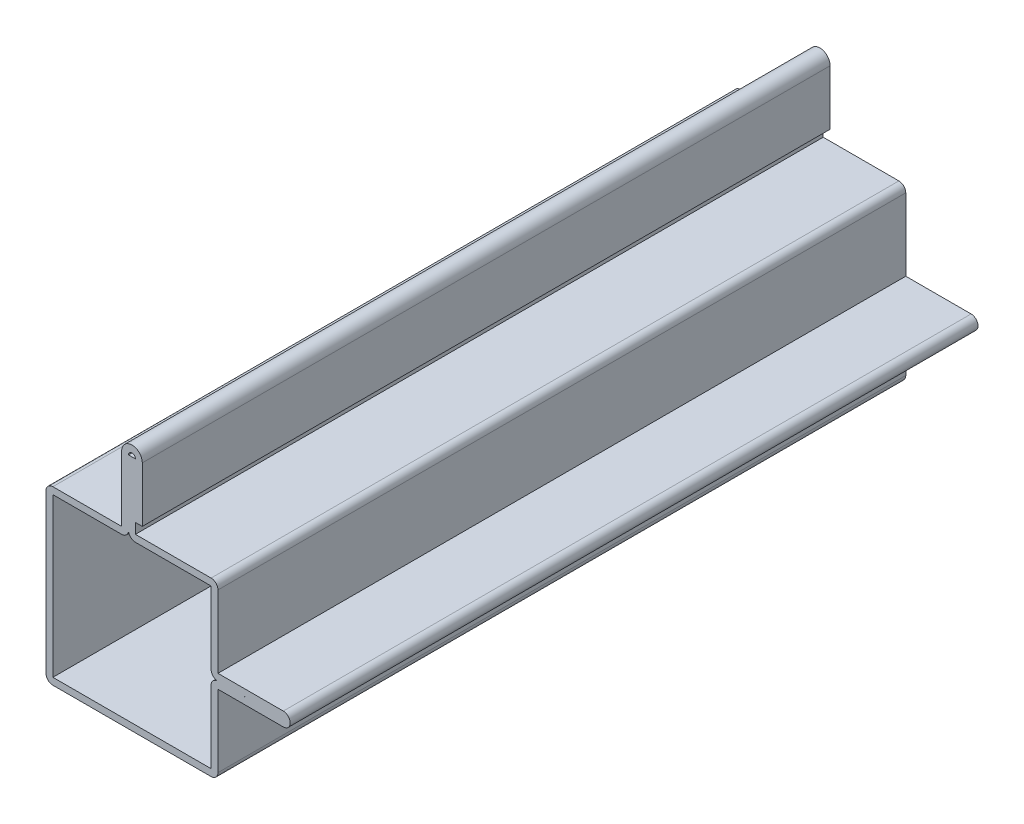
ISO-10303-21;
HEADER;
FILE_DESCRIPTION(('STEP AP214'),'2;1');
FILE_NAME('part.step','',(''),(''),'','','');
FILE_SCHEMA(('AUTOMOTIVE_DESIGN { 1 0 10303 214 1 1 1 1 }'));
ENDSEC;
DATA;
#1=APPLICATION_CONTEXT('core data for automotive mechanical design processes');
#2=APPLICATION_PROTOCOL_DEFINITION('international standard','automotive_design',2000,#1);
#3=PRODUCT_CONTEXT('',#1,'mechanical');
#4=PRODUCT('Part','Part','',(#3));
#5=PRODUCT_RELATED_PRODUCT_CATEGORY('part','',(#4));
#6=PRODUCT_DEFINITION_FORMATION('','',#4);
#7=PRODUCT_DEFINITION_CONTEXT('part definition',#1,'design');
#8=PRODUCT_DEFINITION('design','',#6,#7);
#9=PRODUCT_DEFINITION_SHAPE('','',#8);
#10=(LENGTH_UNIT() NAMED_UNIT(*) SI_UNIT(.MILLI.,.METRE.));
#11=(NAMED_UNIT(*) PLANE_ANGLE_UNIT() SI_UNIT($,.RADIAN.));
#12=(NAMED_UNIT(*) SI_UNIT($,.STERADIAN.) SOLID_ANGLE_UNIT());
#13=UNCERTAINTY_MEASURE_WITH_UNIT(LENGTH_MEASURE(1.E-05),#10,'distance_accuracy_value','');
#14=(GEOMETRIC_REPRESENTATION_CONTEXT(3) GLOBAL_UNCERTAINTY_ASSIGNED_CONTEXT((#13)) GLOBAL_UNIT_ASSIGNED_CONTEXT((#10,
#11,#12)) REPRESENTATION_CONTEXT('',''));
#15=CARTESIAN_POINT('',(0.,0.,0.));
#16=DIRECTION('',(0.,0.,1.));
#17=DIRECTION('',(1.,0.,0.));
#18=AXIS2_PLACEMENT_3D('',#15,#16,#17);
#19=CARTESIAN_POINT('',(24.,68.,200.));
#20=DIRECTION('',(0.,0.,-1.));
#21=DIRECTION('',(-1.,0.,0.));
#22=AXIS2_PLACEMENT_3D('',#19,#20,#21);
#23=CYLINDRICAL_SURFACE('',#22,3.0001);
#24=CARTESIAN_POINT('',(24.,68.,0.));
#25=DIRECTION('',(0.,0.,1.));
#26=DIRECTION('',(-1.,0.,0.));
#27=AXIS2_PLACEMENT_3D('',#24,#25,#26);
#28=CIRCLE('',#27,3.0001);
#29=CARTESIAN_POINT('',(27.0001,68.,0.));
#30=VERTEX_POINT('',#29);
#31=CARTESIAN_POINT('',(20.9999,68.,0.));
#32=VERTEX_POINT('',#31);
#33=EDGE_CURVE('E267',#30,#32,#28,.T.);
#34=ORIENTED_EDGE('',*,*,#33,.T.);
#35=DIRECTION('',(0.,0.,-1.));
#36=VECTOR('',#35,1.);
#37=CARTESIAN_POINT('',(20.9999,68.,200.));
#38=LINE('',#37,#36);
#39=CARTESIAN_POINT('',(20.9999,68.,200.));
#40=VERTEX_POINT('',#39);
#41=EDGE_CURVE('E275',#40,#32,#38,.T.);
#42=ORIENTED_EDGE('',*,*,#41,.F.);
#43=CARTESIAN_POINT('',(24.,68.,200.));
#44=DIRECTION('',(0.,0.,1.));
#45=DIRECTION('',(-1.,0.,0.));
#46=AXIS2_PLACEMENT_3D('',#43,#44,#45);
#47=CIRCLE('',#46,3.0001);
#48=CARTESIAN_POINT('',(27.0001,68.,200.));
#49=VERTEX_POINT('',#48);
#50=EDGE_CURVE('E346',#49,#40,#47,.T.);
#51=ORIENTED_EDGE('',*,*,#50,.F.);
#52=DIRECTION('',(0.,0.,-1.));
#53=VECTOR('',#52,1.);
#54=CARTESIAN_POINT('',(27.0001,68.,200.));
#55=LINE('',#54,#53);
#56=EDGE_CURVE('E286',#49,#30,#55,.T.);
#57=ORIENTED_EDGE('',*,*,#56,.T.);
#58=EDGE_LOOP('',(#34,#42,#51,#57));
#59=FACE_BOUND('',#58,.T.);
#60=ADVANCED_FACE('F29',(#59),#23,.T.);
#61=CARTESIAN_POINT('',(20.9999,49.,200.));
#62=DIRECTION('',(1.,0.,0.));
#63=DIRECTION('',(0.,0.,-1.));
#64=AXIS2_PLACEMENT_3D('',#61,#62,#63);
#65=PLANE('',#64);
#66=DIRECTION('',(0.,-1.,0.));
#67=VECTOR('',#66,1.);
#68=CARTESIAN_POINT('',(20.9999,49.,0.));
#69=LINE('',#68,#67);
#70=CARTESIAN_POINT('',(20.9999,49.,0.));
#71=VERTEX_POINT('',#70);
#72=EDGE_CURVE('E261',#32,#71,#69,.T.);
#73=ORIENTED_EDGE('',*,*,#72,.T.);
#74=DIRECTION('',(0.,0.,-1.));
#75=VECTOR('',#74,1.);
#76=CARTESIAN_POINT('',(20.9999,49.,200.));
#77=LINE('',#76,#75);
#78=CARTESIAN_POINT('',(20.9999,49.,200.));
#79=VERTEX_POINT('',#78);
#80=EDGE_CURVE('E282',#79,#71,#77,.T.);
#81=ORIENTED_EDGE('',*,*,#80,.F.);
#82=DIRECTION('',(0.,-1.,0.));
#83=VECTOR('',#82,1.);
#84=CARTESIAN_POINT('',(20.9999,49.,200.));
#85=LINE('',#84,#83);
#86=EDGE_CURVE('E277',#40,#79,#85,.T.);
#87=ORIENTED_EDGE('',*,*,#86,.F.);
#88=ORIENTED_EDGE('',*,*,#41,.T.);
#89=EDGE_LOOP('',(#73,#81,#87,#88));
#90=FACE_BOUND('',#89,.T.);
#91=ADVANCED_FACE('F276',(#90),#65,.F.);
#92=CARTESIAN_POINT('',(-1.,49.,200.));
#93=DIRECTION('',(0.,-1.,0.));
#94=DIRECTION('',(0.,0.,-1.));
#95=AXIS2_PLACEMENT_3D('',#92,#93,#94);
#96=PLANE('',#95);
#97=DIRECTION('',(-1.,0.,0.));
#98=VECTOR('',#97,1.);
#99=CARTESIAN_POINT('',(-1.,49.,0.));
#100=LINE('',#99,#98);
#101=CARTESIAN_POINT('',(1.,49.,0.));
#102=VERTEX_POINT('',#101);
#103=EDGE_CURVE('E269',#71,#102,#100,.T.);
#104=ORIENTED_EDGE('',*,*,#103,.T.);
#105=DIRECTION('',(0.,0.,-1.));
#106=VECTOR('',#105,1.);
#107=CARTESIAN_POINT('',(1.,49.,200.));
#108=LINE('',#107,#106);
#109=CARTESIAN_POINT('',(1.,49.,200.));
#110=VERTEX_POINT('',#109);
#111=EDGE_CURVE('E502',#102,#110,#108,.F.);
#112=ORIENTED_EDGE('',*,*,#111,.T.);
#113=DIRECTION('',(-1.,0.,0.));
#114=VECTOR('',#113,1.);
#115=CARTESIAN_POINT('',(-1.,49.,200.));
#116=LINE('',#115,#114);
#117=EDGE_CURVE('E349',#79,#110,#116,.T.);
#118=ORIENTED_EDGE('',*,*,#117,.F.);
#119=ORIENTED_EDGE('',*,*,#80,.T.);
#120=EDGE_LOOP('',(#104,#112,#118,#119));
#121=FACE_BOUND('',#120,.T.);
#122=ADVANCED_FACE('F609',(#121),#96,.F.);
#123=CARTESIAN_POINT('',(-1.,-1.,200.));
#124=DIRECTION('',(1.,0.,0.));
#125=DIRECTION('',(0.,0.,-1.));
#126=AXIS2_PLACEMENT_3D('',#123,#124,#125);
#127=PLANE('',#126);
#128=DIRECTION('',(0.,-1.,0.));
#129=VECTOR('',#128,1.);
#130=CARTESIAN_POINT('',(-1.,-1.,0.));
#131=LINE('',#130,#129);
#132=CARTESIAN_POINT('',(-1.,47.,0.));
#133=VERTEX_POINT('',#132);
#134=CARTESIAN_POINT('',(-1.,1.,0.));
#135=VERTEX_POINT('',#134);
#136=EDGE_CURVE('E290',#133,#135,#131,.T.);
#137=ORIENTED_EDGE('',*,*,#136,.T.);
#138=DIRECTION('',(0.,0.,-1.));
#139=VECTOR('',#138,1.);
#140=CARTESIAN_POINT('',(-1.,1.,200.));
#141=LINE('',#140,#139);
#142=CARTESIAN_POINT('',(-1.,1.,200.));
#143=VERTEX_POINT('',#142);
#144=EDGE_CURVE('E500',#135,#143,#141,.F.);
#145=ORIENTED_EDGE('',*,*,#144,.T.);
#146=DIRECTION('',(0.,-1.,0.));
#147=VECTOR('',#146,1.);
#148=CARTESIAN_POINT('',(-1.,-1.,200.));
#149=LINE('',#148,#147);
#150=CARTESIAN_POINT('',(-1.,47.,200.));
#151=VERTEX_POINT('',#150);
#152=EDGE_CURVE('E352',#151,#143,#149,.T.);
#153=ORIENTED_EDGE('',*,*,#152,.F.);
#154=DIRECTION('',(0.,0.,-1.));
#155=VECTOR('',#154,1.);
#156=CARTESIAN_POINT('',(-1.,47.,200.));
#157=LINE('',#156,#155);
#158=EDGE_CURVE('E497',#151,#133,#157,.T.);
#159=ORIENTED_EDGE('',*,*,#158,.T.);
#160=EDGE_LOOP('',(#137,#145,#153,#159));
#161=FACE_BOUND('',#160,.T.);
#162=ADVANCED_FACE('F617',(#161),#127,.F.);
#163=CARTESIAN_POINT('',(-1.,-1.,200.));
#164=DIRECTION('',(0.,1.,0.));
#165=DIRECTION('',(0.,0.,1.));
#166=AXIS2_PLACEMENT_3D('',#163,#164,#165);
#167=PLANE('',#166);
#168=DIRECTION('',(1.,0.,0.));
#169=VECTOR('',#168,1.);
#170=CARTESIAN_POINT('',(-1.,-1.,0.));
#171=LINE('',#170,#169);
#172=CARTESIAN_POINT('',(1.,-1.,0.));
#173=VERTEX_POINT('',#172);
#174=CARTESIAN_POINT('',(47.,-1.,0.));
#175=VERTEX_POINT('',#174);
#176=EDGE_CURVE('E293',#173,#175,#171,.T.);
#177=ORIENTED_EDGE('',*,*,#176,.T.);
#178=DIRECTION('',(0.,0.,-1.));
#179=VECTOR('',#178,1.);
#180=CARTESIAN_POINT('',(47.,-1.,200.));
#181=LINE('',#180,#179);
#182=CARTESIAN_POINT('',(47.,-1.,200.));
#183=VERTEX_POINT('',#182);
#184=EDGE_CURVE('E478',#175,#183,#181,.F.);
#185=ORIENTED_EDGE('',*,*,#184,.T.);
#186=DIRECTION('',(1.,0.,0.));
#187=VECTOR('',#186,1.);
#188=CARTESIAN_POINT('',(-1.,-1.,200.));
#189=LINE('',#188,#187);
#190=CARTESIAN_POINT('',(1.,-1.,200.));
#191=VERTEX_POINT('',#190);
#192=EDGE_CURVE('E355',#191,#183,#189,.T.);
#193=ORIENTED_EDGE('',*,*,#192,.F.);
#194=DIRECTION('',(0.,0.,-1.));
#195=VECTOR('',#194,1.);
#196=CARTESIAN_POINT('',(1.,-1.,200.));
#197=LINE('',#196,#195);
#198=EDGE_CURVE('E475',#191,#173,#197,.T.);
#199=ORIENTED_EDGE('',*,*,#198,.T.);
#200=EDGE_LOOP('',(#177,#185,#193,#199));
#201=FACE_BOUND('',#200,.T.);
#202=ADVANCED_FACE('F626',(#201),#167,.F.);
#203=CARTESIAN_POINT('',(49.,-1.,200.));
#204=DIRECTION('',(-1.,0.,0.));
#205=DIRECTION('',(0.,0.,1.));
#206=AXIS2_PLACEMENT_3D('',#203,#204,#205);
#207=PLANE('',#206);
#208=DIRECTION('',(0.,1.,0.));
#209=VECTOR('',#208,1.);
#210=CARTESIAN_POINT('',(49.,-1.,200.));
#211=LINE('',#210,#209);
#212=CARTESIAN_POINT('',(49.,1.,200.));
#213=VERTEX_POINT('',#212);
#214=CARTESIAN_POINT('',(49.,21.9995,200.));
#215=VERTEX_POINT('',#214);
#216=EDGE_CURVE('E358',#213,#215,#211,.T.);
#217=ORIENTED_EDGE('',*,*,#216,.F.);
#218=DIRECTION('',(0.,0.,-1.));
#219=VECTOR('',#218,1.);
#220=CARTESIAN_POINT('',(49.,1.,200.));
#221=LINE('',#220,#219);
#222=CARTESIAN_POINT('',(49.,1.,0.));
#223=VERTEX_POINT('',#222);
#224=EDGE_CURVE('E281',#213,#223,#221,.T.);
#225=ORIENTED_EDGE('',*,*,#224,.T.);
#226=DIRECTION('',(0.,1.,0.));
#227=VECTOR('',#226,1.);
#228=CARTESIAN_POINT('',(49.,-1.,0.));
#229=LINE('',#228,#227);
#230=CARTESIAN_POINT('',(49.,21.9995,0.));
#231=VERTEX_POINT('',#230);
#232=EDGE_CURVE('E296',#223,#231,#229,.T.);
#233=ORIENTED_EDGE('',*,*,#232,.T.);
#234=DIRECTION('',(0.,0.,-1.));
#235=VECTOR('',#234,1.);
#236=CARTESIAN_POINT('',(49.,21.9995,200.));
#237=LINE('',#236,#235);
#238=EDGE_CURVE('E457',#215,#231,#237,.T.);
#239=ORIENTED_EDGE('',*,*,#238,.F.);
#240=EDGE_LOOP('',(#217,#225,#233,#239));
#241=FACE_BOUND('',#240,.T.);
#242=ADVANCED_FACE('F635',(#241),#207,.F.);
#243=CARTESIAN_POINT('',(49.,21.9995,200.));
#244=DIRECTION('',(0.,1.,0.));
#245=DIRECTION('',(0.,0.,1.));
#246=AXIS2_PLACEMENT_3D('',#243,#244,#245);
#247=PLANE('',#246);
#248=DIRECTION('',(1.,0.,0.));
#249=VECTOR('',#248,1.);
#250=CARTESIAN_POINT('',(49.,21.9995,0.));
#251=LINE('',#250,#249);
#252=CARTESIAN_POINT('',(68.,21.9995,0.));
#253=VERTEX_POINT('',#252);
#254=EDGE_CURVE('E298',#231,#253,#251,.T.);
#255=ORIENTED_EDGE('',*,*,#254,.T.);
#256=DIRECTION('',(0.,0.,-1.));
#257=VECTOR('',#256,1.);
#258=CARTESIAN_POINT('',(68.,21.9995,200.));
#259=LINE('',#258,#257);
#260=CARTESIAN_POINT('',(68.,21.9995,200.));
#261=VERTEX_POINT('',#260);
#262=EDGE_CURVE('E454',#261,#253,#259,.T.);
#263=ORIENTED_EDGE('',*,*,#262,.F.);
#264=DIRECTION('',(1.,0.,0.));
#265=VECTOR('',#264,1.);
#266=CARTESIAN_POINT('',(49.,21.9995,200.));
#267=LINE('',#266,#265);
#268=EDGE_CURVE('E360',#215,#261,#267,.T.);
#269=ORIENTED_EDGE('',*,*,#268,.F.);
#270=ORIENTED_EDGE('',*,*,#238,.T.);
#271=EDGE_LOOP('',(#255,#263,#269,#270));
#272=FACE_BOUND('',#271,.T.);
#273=ADVANCED_FACE('F641',(#272),#247,.F.);
#274=CARTESIAN_POINT('',(68.,24.,200.));
#275=DIRECTION('',(0.,0.,-1.));
#276=DIRECTION('',(-1.,0.,0.));
#277=AXIS2_PLACEMENT_3D('',#274,#275,#276);
#278=CYLINDRICAL_SURFACE('',#277,2.0005);
#279=CARTESIAN_POINT('',(68.,24.,0.));
#280=DIRECTION('',(0.,0.,1.));
#281=DIRECTION('',(1.,0.,0.));
#282=AXIS2_PLACEMENT_3D('',#279,#280,#281);
#283=CIRCLE('',#282,2.0005);
#284=CARTESIAN_POINT('',(68.,26.0005,0.));
#285=VERTEX_POINT('',#284);
#286=EDGE_CURVE('E300',#253,#285,#283,.T.);
#287=ORIENTED_EDGE('',*,*,#286,.T.);
#288=DIRECTION('',(0.,0.,-1.));
#289=VECTOR('',#288,1.);
#290=CARTESIAN_POINT('',(68.,26.0005,200.));
#291=LINE('',#290,#289);
#292=CARTESIAN_POINT('',(68.,26.0005,200.));
#293=VERTEX_POINT('',#292);
#294=EDGE_CURVE('E451',#293,#285,#291,.T.);
#295=ORIENTED_EDGE('',*,*,#294,.F.);
#296=CARTESIAN_POINT('',(68.,24.,200.));
#297=DIRECTION('',(0.,0.,1.));
#298=DIRECTION('',(1.,0.,0.));
#299=AXIS2_PLACEMENT_3D('',#296,#297,#298);
#300=CIRCLE('',#299,2.0005);
#301=EDGE_CURVE('E362',#261,#293,#300,.T.);
#302=ORIENTED_EDGE('',*,*,#301,.F.);
#303=ORIENTED_EDGE('',*,*,#262,.T.);
#304=EDGE_LOOP('',(#287,#295,#302,#303));
#305=FACE_BOUND('',#304,.T.);
#306=ADVANCED_FACE('F647',(#305),#278,.T.);
#307=CARTESIAN_POINT('',(68.,26.0005,200.));
#308=DIRECTION('',(0.,-1.,0.));
#309=DIRECTION('',(1.,0.,0.));
#310=AXIS2_PLACEMENT_3D('',#307,#308,#309);
#311=PLANE('',#310);
#312=DIRECTION('',(-1.,0.,0.));
#313=VECTOR('',#312,1.);
#314=CARTESIAN_POINT('',(68.,26.0005,0.));
#315=LINE('',#314,#313);
#316=CARTESIAN_POINT('',(49.,26.0005,0.));
#317=VERTEX_POINT('',#316);
#318=EDGE_CURVE('E302',#285,#317,#315,.T.);
#319=ORIENTED_EDGE('',*,*,#318,.T.);
#320=DIRECTION('',(0.,0.,-1.));
#321=VECTOR('',#320,1.);
#322=CARTESIAN_POINT('',(49.,26.0005,200.));
#323=LINE('',#322,#321);
#324=CARTESIAN_POINT('',(49.,26.0005,200.));
#325=VERTEX_POINT('',#324);
#326=EDGE_CURVE('E448',#325,#317,#323,.T.);
#327=ORIENTED_EDGE('',*,*,#326,.F.);
#328=DIRECTION('',(-1.,0.,0.));
#329=VECTOR('',#328,1.);
#330=CARTESIAN_POINT('',(68.,26.0005,200.));
#331=LINE('',#330,#329);
#332=EDGE_CURVE('E364',#293,#325,#331,.T.);
#333=ORIENTED_EDGE('',*,*,#332,.F.);
#334=ORIENTED_EDGE('',*,*,#294,.T.);
#335=EDGE_LOOP('',(#319,#327,#333,#334));
#336=FACE_BOUND('',#335,.T.);
#337=ADVANCED_FACE('F651',(#336),#311,.F.);
#338=CARTESIAN_POINT('',(49.,26.0005,200.));
#339=DIRECTION('',(-1.,0.,0.));
#340=DIRECTION('',(0.,0.,1.));
#341=AXIS2_PLACEMENT_3D('',#338,#339,#340);
#342=PLANE('',#341);
#343=DIRECTION('',(0.,1.,0.));
#344=VECTOR('',#343,1.);
#345=CARTESIAN_POINT('',(49.,26.0005,0.));
#346=LINE('',#345,#344);
#347=CARTESIAN_POINT('',(49.,47.,0.));
#348=VERTEX_POINT('',#347);
#349=EDGE_CURVE('E304',#317,#348,#346,.T.);
#350=ORIENTED_EDGE('',*,*,#349,.T.);
#351=DIRECTION('',(0.,0.,-1.));
#352=VECTOR('',#351,1.);
#353=CARTESIAN_POINT('',(49.,47.,200.));
#354=LINE('',#353,#352);
#355=CARTESIAN_POINT('',(49.,47.,200.));
#356=VERTEX_POINT('',#355);
#357=EDGE_CURVE('E495',#348,#356,#354,.F.);
#358=ORIENTED_EDGE('',*,*,#357,.T.);
#359=DIRECTION('',(0.,1.,0.));
#360=VECTOR('',#359,1.);
#361=CARTESIAN_POINT('',(49.,26.0005,200.));
#362=LINE('',#361,#360);
#363=EDGE_CURVE('E366',#325,#356,#362,.T.);
#364=ORIENTED_EDGE('',*,*,#363,.F.);
#365=ORIENTED_EDGE('',*,*,#326,.T.);
#366=EDGE_LOOP('',(#350,#358,#364,#365));
#367=FACE_BOUND('',#366,.T.);
#368=ADVANCED_FACE('F655',(#367),#342,.F.);
#369=CARTESIAN_POINT('',(25.,49.,200.));
#370=DIRECTION('',(0.,-1.,0.));
#371=DIRECTION('',(0.,0.,-1.));
#372=AXIS2_PLACEMENT_3D('',#369,#370,#371);
#373=PLANE('',#372);
#374=DIRECTION('',(-1.,0.,0.));
#375=VECTOR('',#374,1.);
#376=CARTESIAN_POINT('',(25.,49.,200.));
#377=LINE('',#376,#375);
#378=CARTESIAN_POINT('',(47.,49.,200.));
#379=VERTEX_POINT('',#378);
#380=CARTESIAN_POINT('',(25.,49.,200.));
#381=VERTEX_POINT('',#380);
#382=EDGE_CURVE('E369',#379,#381,#377,.T.);
#383=ORIENTED_EDGE('',*,*,#382,.F.);
#384=DIRECTION('',(0.,0.,-1.));
#385=VECTOR('',#384,1.);
#386=CARTESIAN_POINT('',(47.,49.,200.));
#387=LINE('',#386,#385);
#388=CARTESIAN_POINT('',(47.,49.,0.));
#389=VERTEX_POINT('',#388);
#390=EDGE_CURVE('E492',#379,#389,#387,.T.);
#391=ORIENTED_EDGE('',*,*,#390,.T.);
#392=DIRECTION('',(-1.,0.,0.));
#393=VECTOR('',#392,1.);
#394=CARTESIAN_POINT('',(25.,49.,0.));
#395=LINE('',#394,#393);
#396=CARTESIAN_POINT('',(25.,49.,0.));
#397=VERTEX_POINT('',#396);
#398=EDGE_CURVE('E307',#389,#397,#395,.T.);
#399=ORIENTED_EDGE('',*,*,#398,.T.);
#400=DIRECTION('',(0.,0.,-1.));
#401=VECTOR('',#400,1.);
#402=CARTESIAN_POINT('',(25.,49.,200.));
#403=LINE('',#402,#401);
#404=EDGE_CURVE('E445',#381,#397,#403,.T.);
#405=ORIENTED_EDGE('',*,*,#404,.F.);
#406=EDGE_LOOP('',(#383,#391,#399,#405));
#407=FACE_BOUND('',#406,.T.);
#408=ADVANCED_FACE('F664',(#407),#373,.F.);
#409=CARTESIAN_POINT('',(25.,49.,200.));
#410=DIRECTION('',(-1.,0.,0.));
#411=DIRECTION('',(0.,0.,1.));
#412=AXIS2_PLACEMENT_3D('',#409,#410,#411);
#413=PLANE('',#412);
#414=DIRECTION('',(0.,1.,0.));
#415=VECTOR('',#414,1.);
#416=CARTESIAN_POINT('',(25.,49.,0.));
#417=LINE('',#416,#415);
#418=CARTESIAN_POINT('',(25.,68.,0.));
#419=VERTEX_POINT('',#418);
#420=EDGE_CURVE('E309',#397,#419,#417,.T.);
#421=ORIENTED_EDGE('',*,*,#420,.T.);
#422=DIRECTION('',(0.,0.,-1.));
#423=VECTOR('',#422,1.);
#424=CARTESIAN_POINT('',(25.,68.,200.));
#425=LINE('',#424,#423);
#426=CARTESIAN_POINT('',(25.,68.,200.));
#427=VERTEX_POINT('',#426);
#428=EDGE_CURVE('E442',#427,#419,#425,.T.);
#429=ORIENTED_EDGE('',*,*,#428,.F.);
#430=DIRECTION('',(0.,1.,0.));
#431=VECTOR('',#430,1.);
#432=CARTESIAN_POINT('',(25.,49.,200.));
#433=LINE('',#432,#431);
#434=EDGE_CURVE('E371',#381,#427,#433,.T.);
#435=ORIENTED_EDGE('',*,*,#434,.F.);
#436=ORIENTED_EDGE('',*,*,#404,.T.);
#437=EDGE_LOOP('',(#421,#429,#435,#436));
#438=FACE_BOUND('',#437,.T.);
#439=ADVANCED_FACE('F670',(#438),#413,.F.);
#440=CARTESIAN_POINT('',(25.,68.,200.));
#441=DIRECTION('',(0.,-1.,0.));
#442=DIRECTION('',(0.,0.,-1.));
#443=AXIS2_PLACEMENT_3D('',#440,#441,#442);
#444=PLANE('',#443);
#445=DIRECTION('',(-1.,0.,0.));
#446=VECTOR('',#445,1.);
#447=CARTESIAN_POINT('',(25.,68.,0.));
#448=LINE('',#447,#446);
#449=CARTESIAN_POINT('',(23.,68.,0.));
#450=VERTEX_POINT('',#449);
#451=EDGE_CURVE('E311',#419,#450,#448,.T.);
#452=ORIENTED_EDGE('',*,*,#451,.T.);
#453=DIRECTION('',(0.,0.,-1.));
#454=VECTOR('',#453,1.);
#455=CARTESIAN_POINT('',(23.,68.,200.));
#456=LINE('',#455,#454);
#457=CARTESIAN_POINT('',(23.,68.,200.));
#458=VERTEX_POINT('',#457);
#459=EDGE_CURVE('E439',#458,#450,#456,.T.);
#460=ORIENTED_EDGE('',*,*,#459,.F.);
#461=DIRECTION('',(-1.,0.,0.));
#462=VECTOR('',#461,1.);
#463=CARTESIAN_POINT('',(25.,68.,200.));
#464=LINE('',#463,#462);
#465=EDGE_CURVE('E373',#427,#458,#464,.T.);
#466=ORIENTED_EDGE('',*,*,#465,.F.);
#467=ORIENTED_EDGE('',*,*,#428,.T.);
#468=EDGE_LOOP('',(#452,#460,#466,#467));
#469=FACE_BOUND('',#468,.T.);
#470=ADVANCED_FACE('F674',(#469),#444,.F.);
#471=CARTESIAN_POINT('',(23.,47.,200.));
#472=DIRECTION('',(1.,0.,0.));
#473=DIRECTION('',(0.,0.,-1.));
#474=AXIS2_PLACEMENT_3D('',#471,#472,#473);
#475=PLANE('',#474);
#476=DIRECTION('',(0.,-1.,0.));
#477=VECTOR('',#476,1.);
#478=CARTESIAN_POINT('',(23.,47.,0.));
#479=LINE('',#478,#477);
#480=CARTESIAN_POINT('',(23.,49.,0.));
#481=VERTEX_POINT('',#480);
#482=EDGE_CURVE('E313',#450,#481,#479,.T.);
#483=ORIENTED_EDGE('',*,*,#482,.T.);
#484=DIRECTION('',(0.,0.,-1.));
#485=VECTOR('',#484,1.);
#486=CARTESIAN_POINT('',(23.,49.,200.));
#487=LINE('',#486,#485);
#488=CARTESIAN_POINT('',(23.,49.,200.));
#489=VERTEX_POINT('',#488);
#490=EDGE_CURVE('E11',#481,#489,#487,.F.);
#491=ORIENTED_EDGE('',*,*,#490,.T.);
#492=DIRECTION('',(0.,-1.,0.));
#493=VECTOR('',#492,1.);
#494=CARTESIAN_POINT('',(23.,47.,200.));
#495=LINE('',#494,#493);
#496=EDGE_CURVE('E375',#458,#489,#495,.T.);
#497=ORIENTED_EDGE('',*,*,#496,.F.);
#498=ORIENTED_EDGE('',*,*,#459,.T.);
#499=EDGE_LOOP('',(#483,#491,#497,#498));
#500=FACE_BOUND('',#499,.T.);
#501=ADVANCED_FACE('F712',(#500),#475,.F.);
#502=CARTESIAN_POINT('',(23.,47.,200.));
#503=DIRECTION('',(0.,1.,0.));
#504=DIRECTION('',(0.,0.,1.));
#505=AXIS2_PLACEMENT_3D('',#502,#503,#504);
#506=PLANE('',#505);
#507=DIRECTION('',(1.,0.,0.));
#508=VECTOR('',#507,1.);
#509=CARTESIAN_POINT('',(23.,47.,200.));
#510=LINE('',#509,#508);
#511=CARTESIAN_POINT('',(25.,47.,200.));
#512=VERTEX_POINT('',#511);
#513=CARTESIAN_POINT('',(47.,47.,200.));
#514=VERTEX_POINT('',#513);
#515=EDGE_CURVE('E377',#512,#514,#510,.T.);
#516=ORIENTED_EDGE('',*,*,#515,.F.);
#517=DIRECTION('',(0.,0.,-1.));
#518=VECTOR('',#517,1.);
#519=CARTESIAN_POINT('',(25.,47.,200.));
#520=LINE('',#519,#518);
#521=CARTESIAN_POINT('',(25.,47.,0.));
#522=VERTEX_POINT('',#521);
#523=EDGE_CURVE('E36',#512,#522,#520,.T.);
#524=ORIENTED_EDGE('',*,*,#523,.T.);
#525=DIRECTION('',(1.,0.,0.));
#526=VECTOR('',#525,1.);
#527=CARTESIAN_POINT('',(23.,47.,0.));
#528=LINE('',#527,#526);
#529=CARTESIAN_POINT('',(47.,47.,0.));
#530=VERTEX_POINT('',#529);
#531=EDGE_CURVE('E315',#522,#530,#528,.T.);
#532=ORIENTED_EDGE('',*,*,#531,.T.);
#533=DIRECTION('',(0.,0.,-1.));
#534=VECTOR('',#533,1.);
#535=CARTESIAN_POINT('',(47.,47.,200.));
#536=LINE('',#535,#534);
#537=EDGE_CURVE('E436',#514,#530,#536,.T.);
#538=ORIENTED_EDGE('',*,*,#537,.F.);
#539=EDGE_LOOP('',(#516,#524,#532,#538));
#540=FACE_BOUND('',#539,.T.);
#541=ADVANCED_FACE('F529',(#540),#506,.F.);
#542=CARTESIAN_POINT('',(47.,24.0005,200.));
#543=DIRECTION('',(1.,0.,0.));
#544=DIRECTION('',(0.,0.,-1.));
#545=AXIS2_PLACEMENT_3D('',#542,#543,#544);
#546=PLANE('',#545);
#547=DIRECTION('',(0.,-1.,0.));
#548=VECTOR('',#547,1.);
#549=CARTESIAN_POINT('',(47.,24.0005,0.));
#550=LINE('',#549,#548);
#551=CARTESIAN_POINT('',(47.,26.0005,0.));
#552=VERTEX_POINT('',#551);
#553=EDGE_CURVE('E317',#530,#552,#550,.T.);
#554=ORIENTED_EDGE('',*,*,#553,.T.);
#555=DIRECTION('',(0.,0.,-1.));
#556=VECTOR('',#555,1.);
#557=CARTESIAN_POINT('',(47.,26.0005,200.));
#558=LINE('',#557,#556);
#559=CARTESIAN_POINT('',(47.,26.0005,200.));
#560=VERTEX_POINT('',#559);
#561=EDGE_CURVE('E521',#552,#560,#558,.F.);
#562=ORIENTED_EDGE('',*,*,#561,.T.);
#563=DIRECTION('',(0.,-1.,0.));
#564=VECTOR('',#563,1.);
#565=CARTESIAN_POINT('',(47.,24.0005,200.));
#566=LINE('',#565,#564);
#567=EDGE_CURVE('E379',#514,#560,#566,.T.);
#568=ORIENTED_EDGE('',*,*,#567,.F.);
#569=ORIENTED_EDGE('',*,*,#537,.T.);
#570=EDGE_LOOP('',(#554,#562,#568,#569));
#571=FACE_BOUND('',#570,.T.);
#572=ADVANCED_FACE('F536',(#571),#546,.F.);
#573=CARTESIAN_POINT('',(68.,24.0005,200.));
#574=DIRECTION('',(0.,1.,0.));
#575=DIRECTION('',(-1.,0.,0.));
#576=AXIS2_PLACEMENT_3D('',#573,#574,#575);
#577=PLANE('',#576);
#578=DIRECTION('',(1.,0.,0.));
#579=VECTOR('',#578,1.);
#580=CARTESIAN_POINT('',(68.,24.0005,200.));
#581=LINE('',#580,#579);
#582=CARTESIAN_POINT('',(49.,24.0005,200.));
#583=VERTEX_POINT('',#582);
#584=CARTESIAN_POINT('',(68.,24.0005,200.));
#585=VERTEX_POINT('',#584);
#586=EDGE_CURVE('E382',#583,#585,#581,.T.);
#587=ORIENTED_EDGE('',*,*,#586,.F.);
#588=DIRECTION('',(0.,0.,-1.));
#589=VECTOR('',#588,1.);
#590=CARTESIAN_POINT('',(49.,24.0005,200.));
#591=LINE('',#590,#589);
#592=CARTESIAN_POINT('',(49.,24.0005,0.));
#593=VERTEX_POINT('',#592);
#594=EDGE_CURVE('E514',#583,#593,#591,.T.);
#595=ORIENTED_EDGE('',*,*,#594,.T.);
#596=DIRECTION('',(1.,0.,0.));
#597=VECTOR('',#596,1.);
#598=CARTESIAN_POINT('',(68.,24.0005,0.));
#599=LINE('',#598,#597);
#600=CARTESIAN_POINT('',(68.,24.0005,0.));
#601=VERTEX_POINT('',#600);
#602=EDGE_CURVE('E320',#593,#601,#599,.T.);
#603=ORIENTED_EDGE('',*,*,#602,.T.);
#604=DIRECTION('',(0.,0.,-1.));
#605=VECTOR('',#604,1.);
#606=CARTESIAN_POINT('',(68.,24.0005,200.));
#607=LINE('',#606,#605);
#608=EDGE_CURVE('E433',#585,#601,#607,.T.);
#609=ORIENTED_EDGE('',*,*,#608,.F.);
#610=EDGE_LOOP('',(#587,#595,#603,#609));
#611=FACE_BOUND('',#610,.T.);
#612=ADVANCED_FACE('F546',(#611),#577,.F.);
#613=CARTESIAN_POINT('',(68.,24.,200.));
#614=DIRECTION('',(0.,0.,-1.));
#615=DIRECTION('',(-1.,0.,0.));
#616=AXIS2_PLACEMENT_3D('',#613,#614,#615);
#617=CYLINDRICAL_SURFACE('',#616,0.0005000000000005);
#618=CARTESIAN_POINT('',(68.,24.,0.));
#619=DIRECTION('',(0.,0.,-1.));
#620=DIRECTION('',(1.,0.,0.));
#621=AXIS2_PLACEMENT_3D('',#618,#619,#620);
#622=CIRCLE('',#621,0.0005000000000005);
#623=CARTESIAN_POINT('',(68.,23.9995,0.));
#624=VERTEX_POINT('',#623);
#625=EDGE_CURVE('E322',#601,#624,#622,.T.);
#626=ORIENTED_EDGE('',*,*,#625,.T.);
#627=DIRECTION('',(0.,0.,-1.));
#628=VECTOR('',#627,1.);
#629=CARTESIAN_POINT('',(68.,23.9995,200.));
#630=LINE('',#629,#628);
#631=CARTESIAN_POINT('',(68.,23.9995,200.));
#632=VERTEX_POINT('',#631);
#633=EDGE_CURVE('E430',#632,#624,#630,.T.);
#634=ORIENTED_EDGE('',*,*,#633,.F.);
#635=CARTESIAN_POINT('',(68.,24.,200.));
#636=DIRECTION('',(0.,0.,-1.));
#637=DIRECTION('',(1.,0.,0.));
#638=AXIS2_PLACEMENT_3D('',#635,#636,#637);
#639=CIRCLE('',#638,0.0005000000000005);
#640=EDGE_CURVE('E384',#585,#632,#639,.T.);
#641=ORIENTED_EDGE('',*,*,#640,.F.);
#642=ORIENTED_EDGE('',*,*,#608,.T.);
#643=EDGE_LOOP('',(#626,#634,#641,#642));
#644=FACE_BOUND('',#643,.T.);
#645=ADVANCED_FACE('F551',(#644),#617,.F.);
#646=CARTESIAN_POINT('',(47.,23.9995,200.));
#647=DIRECTION('',(0.,-1.,0.));
#648=DIRECTION('',(0.,0.,-1.));
#649=AXIS2_PLACEMENT_3D('',#646,#647,#648);
#650=PLANE('',#649);
#651=DIRECTION('',(-1.,0.,0.));
#652=VECTOR('',#651,1.);
#653=CARTESIAN_POINT('',(47.,23.9995,0.));
#654=LINE('',#653,#652);
#655=CARTESIAN_POINT('',(49.,23.9995,0.));
#656=VERTEX_POINT('',#655);
#657=EDGE_CURVE('E324',#624,#656,#654,.T.);
#658=ORIENTED_EDGE('',*,*,#657,.T.);
#659=DIRECTION('',(0.,0.,-1.));
#660=VECTOR('',#659,1.);
#661=CARTESIAN_POINT('',(49.,23.9995,200.));
#662=LINE('',#661,#660);
#663=CARTESIAN_POINT('',(49.,23.9995,200.));
#664=VERTEX_POINT('',#663);
#665=EDGE_CURVE('E507',#656,#664,#662,.F.);
#666=ORIENTED_EDGE('',*,*,#665,.T.);
#667=DIRECTION('',(-1.,0.,0.));
#668=VECTOR('',#667,1.);
#669=CARTESIAN_POINT('',(47.,23.9995,200.));
#670=LINE('',#669,#668);
#671=EDGE_CURVE('E386',#632,#664,#670,.T.);
#672=ORIENTED_EDGE('',*,*,#671,.F.);
#673=ORIENTED_EDGE('',*,*,#633,.T.);
#674=EDGE_LOOP('',(#658,#666,#672,#673));
#675=FACE_BOUND('',#674,.T.);
#676=ADVANCED_FACE('F723',(#675),#650,.F.);
#677=CARTESIAN_POINT('',(47.,1.,200.));
#678=DIRECTION('',(1.,0.,0.));
#679=DIRECTION('',(0.,0.,-1.));
#680=AXIS2_PLACEMENT_3D('',#677,#678,#679);
#681=PLANE('',#680);
#682=DIRECTION('',(0.,-1.,0.));
#683=VECTOR('',#682,1.);
#684=CARTESIAN_POINT('',(47.,1.,200.));
#685=LINE('',#684,#683);
#686=CARTESIAN_POINT('',(47.,21.9995,200.));
#687=VERTEX_POINT('',#686);
#688=CARTESIAN_POINT('',(47.,1.,200.));
#689=VERTEX_POINT('',#688);
#690=EDGE_CURVE('E389',#687,#689,#685,.T.);
#691=ORIENTED_EDGE('',*,*,#690,.F.);
#692=DIRECTION('',(0.,0.,-1.));
#693=VECTOR('',#692,1.);
#694=CARTESIAN_POINT('',(47.,21.9995,200.));
#695=LINE('',#694,#693);
#696=CARTESIAN_POINT('',(47.,21.9995,0.));
#697=VERTEX_POINT('',#696);
#698=EDGE_CURVE('E504',#687,#697,#695,.T.);
#699=ORIENTED_EDGE('',*,*,#698,.T.);
#700=DIRECTION('',(0.,-1.,0.));
#701=VECTOR('',#700,1.);
#702=CARTESIAN_POINT('',(47.,1.,0.));
#703=LINE('',#702,#701);
#704=CARTESIAN_POINT('',(47.,1.,0.));
#705=VERTEX_POINT('',#704);
#706=EDGE_CURVE('E327',#697,#705,#703,.T.);
#707=ORIENTED_EDGE('',*,*,#706,.T.);
#708=DIRECTION('',(0.,0.,-1.));
#709=VECTOR('',#708,1.);
#710=CARTESIAN_POINT('',(47.,1.,200.));
#711=LINE('',#710,#709);
#712=EDGE_CURVE('E427',#689,#705,#711,.T.);
#713=ORIENTED_EDGE('',*,*,#712,.F.);
#714=EDGE_LOOP('',(#691,#699,#707,#713));
#715=FACE_BOUND('',#714,.T.);
#716=ADVANCED_FACE('F562',(#715),#681,.F.);
#717=CARTESIAN_POINT('',(1.,1.,200.));
#718=DIRECTION('',(0.,-1.,0.));
#719=DIRECTION('',(0.,0.,-1.));
#720=AXIS2_PLACEMENT_3D('',#717,#718,#719);
#721=PLANE('',#720);
#722=DIRECTION('',(-1.,0.,0.));
#723=VECTOR('',#722,1.);
#724=CARTESIAN_POINT('',(1.,1.,0.));
#725=LINE('',#724,#723);
#726=CARTESIAN_POINT('',(1.,1.,0.));
#727=VERTEX_POINT('',#726);
#728=EDGE_CURVE('E329',#705,#727,#725,.T.);
#729=ORIENTED_EDGE('',*,*,#728,.T.);
#730=DIRECTION('',(0.,0.,-1.));
#731=VECTOR('',#730,1.);
#732=CARTESIAN_POINT('',(1.,1.,200.));
#733=LINE('',#732,#731);
#734=CARTESIAN_POINT('',(1.,1.,200.));
#735=VERTEX_POINT('',#734);
#736=EDGE_CURVE('E424',#735,#727,#733,.T.);
#737=ORIENTED_EDGE('',*,*,#736,.F.);
#738=DIRECTION('',(-1.,0.,0.));
#739=VECTOR('',#738,1.);
#740=CARTESIAN_POINT('',(1.,1.,200.));
#741=LINE('',#740,#739);
#742=EDGE_CURVE('E391',#689,#735,#741,.T.);
#743=ORIENTED_EDGE('',*,*,#742,.F.);
#744=ORIENTED_EDGE('',*,*,#712,.T.);
#745=EDGE_LOOP('',(#729,#737,#743,#744));
#746=FACE_BOUND('',#745,.T.);
#747=ADVANCED_FACE('F570',(#746),#721,.F.);
#748=CARTESIAN_POINT('',(1.,1.,200.));
#749=DIRECTION('',(-1.,0.,0.));
#750=DIRECTION('',(0.,0.,1.));
#751=AXIS2_PLACEMENT_3D('',#748,#749,#750);
#752=PLANE('',#751);
#753=DIRECTION('',(0.,1.,0.));
#754=VECTOR('',#753,1.);
#755=CARTESIAN_POINT('',(1.,1.,0.));
#756=LINE('',#755,#754);
#757=CARTESIAN_POINT('',(1.,47.,0.));
#758=VERTEX_POINT('',#757);
#759=EDGE_CURVE('E331',#727,#758,#756,.T.);
#760=ORIENTED_EDGE('',*,*,#759,.T.);
#761=DIRECTION('',(0.,0.,-1.));
#762=VECTOR('',#761,1.);
#763=CARTESIAN_POINT('',(1.,47.,200.));
#764=LINE('',#763,#762);
#765=CARTESIAN_POINT('',(1.,47.,200.));
#766=VERTEX_POINT('',#765);
#767=EDGE_CURVE('E421',#766,#758,#764,.T.);
#768=ORIENTED_EDGE('',*,*,#767,.F.);
#769=DIRECTION('',(0.,1.,0.));
#770=VECTOR('',#769,1.);
#771=CARTESIAN_POINT('',(1.,1.,200.));
#772=LINE('',#771,#770);
#773=EDGE_CURVE('E393',#735,#766,#772,.T.);
#774=ORIENTED_EDGE('',*,*,#773,.F.);
#775=ORIENTED_EDGE('',*,*,#736,.T.);
#776=EDGE_LOOP('',(#760,#768,#774,#775));
#777=FACE_BOUND('',#776,.T.);
#778=ADVANCED_FACE('F574',(#777),#752,.F.);
#779=CARTESIAN_POINT('',(1.,47.,200.));
#780=DIRECTION('',(0.,1.,0.));
#781=DIRECTION('',(0.,0.,1.));
#782=AXIS2_PLACEMENT_3D('',#779,#780,#781);
#783=PLANE('',#782);
#784=DIRECTION('',(1.,0.,0.));
#785=VECTOR('',#784,1.);
#786=CARTESIAN_POINT('',(1.,47.,0.));
#787=LINE('',#786,#785);
#788=CARTESIAN_POINT('',(20.9999,47.,0.));
#789=VERTEX_POINT('',#788);
#790=EDGE_CURVE('E333',#758,#789,#787,.T.);
#791=ORIENTED_EDGE('',*,*,#790,.T.);
#792=DIRECTION('',(0.,0.,-1.));
#793=VECTOR('',#792,1.);
#794=CARTESIAN_POINT('',(20.9999,47.,200.));
#795=LINE('',#794,#793);
#796=CARTESIAN_POINT('',(20.9999,47.,200.));
#797=VERTEX_POINT('',#796);
#798=EDGE_CURVE('E512',#789,#797,#795,.F.);
#799=ORIENTED_EDGE('',*,*,#798,.T.);
#800=DIRECTION('',(1.,0.,0.));
#801=VECTOR('',#800,1.);
#802=CARTESIAN_POINT('',(1.,47.,200.));
#803=LINE('',#802,#801);
#804=EDGE_CURVE('E395',#766,#797,#803,.T.);
#805=ORIENTED_EDGE('',*,*,#804,.F.);
#806=ORIENTED_EDGE('',*,*,#767,.T.);
#807=EDGE_LOOP('',(#791,#799,#805,#806));
#808=FACE_BOUND('',#807,.T.);
#809=ADVANCED_FACE('F732',(#808),#783,.F.);
#810=CARTESIAN_POINT('',(22.9999,47.,200.));
#811=DIRECTION('',(-1.,0.,0.));
#812=DIRECTION('',(0.,0.,1.));
#813=AXIS2_PLACEMENT_3D('',#810,#811,#812);
#814=PLANE('',#813);
#815=DIRECTION('',(0.,1.,0.));
#816=VECTOR('',#815,1.);
#817=CARTESIAN_POINT('',(22.9999,47.,200.));
#818=LINE('',#817,#816);
#819=CARTESIAN_POINT('',(22.9999,49.,200.));
#820=VERTEX_POINT('',#819);
#821=CARTESIAN_POINT('',(22.9999,68.,200.));
#822=VERTEX_POINT('',#821);
#823=EDGE_CURVE('E398',#820,#822,#818,.T.);
#824=ORIENTED_EDGE('',*,*,#823,.F.);
#825=DIRECTION('',(0.,0.,-1.));
#826=VECTOR('',#825,1.);
#827=CARTESIAN_POINT('',(22.9999,49.,200.));
#828=LINE('',#827,#826);
#829=CARTESIAN_POINT('',(22.9999,49.,0.));
#830=VERTEX_POINT('',#829);
#831=EDGE_CURVE('E509',#820,#830,#828,.T.);
#832=ORIENTED_EDGE('',*,*,#831,.T.);
#833=DIRECTION('',(0.,1.,0.));
#834=VECTOR('',#833,1.);
#835=CARTESIAN_POINT('',(22.9999,47.,0.));
#836=LINE('',#835,#834);
#837=CARTESIAN_POINT('',(22.9999,68.,0.));
#838=VERTEX_POINT('',#837);
#839=EDGE_CURVE('E336',#830,#838,#836,.T.);
#840=ORIENTED_EDGE('',*,*,#839,.T.);
#841=DIRECTION('',(0.,0.,-1.));
#842=VECTOR('',#841,1.);
#843=CARTESIAN_POINT('',(22.9999,68.,200.));
#844=LINE('',#843,#842);
#845=EDGE_CURVE('E418',#822,#838,#844,.T.);
#846=ORIENTED_EDGE('',*,*,#845,.F.);
#847=EDGE_LOOP('',(#824,#832,#840,#846));
#848=FACE_BOUND('',#847,.T.);
#849=ADVANCED_FACE('F586',(#848),#814,.F.);
#850=CARTESIAN_POINT('',(24.,68.,200.));
#851=DIRECTION('',(0.,0.,-1.));
#852=DIRECTION('',(-1.,0.,0.));
#853=AXIS2_PLACEMENT_3D('',#850,#851,#852);
#854=CYLINDRICAL_SURFACE('',#853,1.0001);
#855=CARTESIAN_POINT('',(24.,68.,0.));
#856=DIRECTION('',(0.,0.,-1.));
#857=DIRECTION('',(-1.,0.,0.));
#858=AXIS2_PLACEMENT_3D('',#855,#856,#857);
#859=CIRCLE('',#858,1.0001);
#860=CARTESIAN_POINT('',(25.0001,68.,0.));
#861=VERTEX_POINT('',#860);
#862=EDGE_CURVE('E338',#838,#861,#859,.T.);
#863=ORIENTED_EDGE('',*,*,#862,.T.);
#864=DIRECTION('',(0.,0.,-1.));
#865=VECTOR('',#864,1.);
#866=CARTESIAN_POINT('',(25.0001,68.,200.));
#867=LINE('',#866,#865);
#868=CARTESIAN_POINT('',(25.0001,68.,200.));
#869=VERTEX_POINT('',#868);
#870=EDGE_CURVE('E415',#869,#861,#867,.T.);
#871=ORIENTED_EDGE('',*,*,#870,.F.);
#872=CARTESIAN_POINT('',(24.,68.,200.));
#873=DIRECTION('',(0.,0.,-1.));
#874=DIRECTION('',(-1.,0.,0.));
#875=AXIS2_PLACEMENT_3D('',#872,#873,#874);
#876=CIRCLE('',#875,1.0001);
#877=EDGE_CURVE('E400',#822,#869,#876,.T.);
#878=ORIENTED_EDGE('',*,*,#877,.F.);
#879=ORIENTED_EDGE('',*,*,#845,.T.);
#880=EDGE_LOOP('',(#863,#871,#878,#879));
#881=FACE_BOUND('',#880,.T.);
#882=ADVANCED_FACE('F593',(#881),#854,.F.);
#883=CARTESIAN_POINT('',(25.0001,68.,200.));
#884=DIRECTION('',(1.,0.,0.));
#885=DIRECTION('',(0.,0.,-1.));
#886=AXIS2_PLACEMENT_3D('',#883,#884,#885);
#887=PLANE('',#886);
#888=DIRECTION('',(0.,-1.,0.));
#889=VECTOR('',#888,1.);
#890=CARTESIAN_POINT('',(25.0001,68.,0.));
#891=LINE('',#890,#889);
#892=CARTESIAN_POINT('',(25.0001,52.,0.));
#893=VERTEX_POINT('',#892);
#894=EDGE_CURVE('E340',#861,#893,#891,.T.);
#895=ORIENTED_EDGE('',*,*,#894,.T.);
#896=DIRECTION('',(0.,0.,-1.));
#897=VECTOR('',#896,1.);
#898=CARTESIAN_POINT('',(25.0001,52.,200.));
#899=LINE('',#898,#897);
#900=CARTESIAN_POINT('',(25.0001,52.,200.));
#901=VERTEX_POINT('',#900);
#902=EDGE_CURVE('E412',#901,#893,#899,.T.);
#903=ORIENTED_EDGE('',*,*,#902,.F.);
#904=DIRECTION('',(0.,-1.,0.));
#905=VECTOR('',#904,1.);
#906=CARTESIAN_POINT('',(25.0001,68.,200.));
#907=LINE('',#906,#905);
#908=EDGE_CURVE('E402',#869,#901,#907,.T.);
#909=ORIENTED_EDGE('',*,*,#908,.F.);
#910=ORIENTED_EDGE('',*,*,#870,.T.);
#911=EDGE_LOOP('',(#895,#903,#909,#910));
#912=FACE_BOUND('',#911,.T.);
#913=ADVANCED_FACE('F597',(#912),#887,.F.);
#914=CARTESIAN_POINT('',(27.0001,52.,200.));
#915=DIRECTION('',(0.,1.,0.));
#916=DIRECTION('',(0.,0.,1.));
#917=AXIS2_PLACEMENT_3D('',#914,#915,#916);
#918=PLANE('',#917);
#919=DIRECTION('',(1.,0.,0.));
#920=VECTOR('',#919,1.);
#921=CARTESIAN_POINT('',(27.0001,52.,0.));
#922=LINE('',#921,#920);
#923=CARTESIAN_POINT('',(27.0001,52.,0.));
#924=VERTEX_POINT('',#923);
#925=EDGE_CURVE('E342',#893,#924,#922,.T.);
#926=ORIENTED_EDGE('',*,*,#925,.T.);
#927=DIRECTION('',(0.,0.,-1.));
#928=VECTOR('',#927,1.);
#929=CARTESIAN_POINT('',(27.0001,52.,200.));
#930=LINE('',#929,#928);
#931=CARTESIAN_POINT('',(27.0001,52.,200.));
#932=VERTEX_POINT('',#931);
#933=EDGE_CURVE('E409',#932,#924,#930,.T.);
#934=ORIENTED_EDGE('',*,*,#933,.F.);
#935=DIRECTION('',(1.,0.,0.));
#936=VECTOR('',#935,1.);
#937=CARTESIAN_POINT('',(27.0001,52.,200.));
#938=LINE('',#937,#936);
#939=EDGE_CURVE('E404',#901,#932,#938,.T.);
#940=ORIENTED_EDGE('',*,*,#939,.F.);
#941=ORIENTED_EDGE('',*,*,#902,.T.);
#942=EDGE_LOOP('',(#926,#934,#940,#941));
#943=FACE_BOUND('',#942,.T.);
#944=ADVANCED_FACE('F603',(#943),#918,.F.);
#945=CARTESIAN_POINT('',(27.0001,68.,200.));
#946=DIRECTION('',(-1.,0.,0.));
#947=DIRECTION('',(0.,0.,1.));
#948=AXIS2_PLACEMENT_3D('',#945,#946,#947);
#949=PLANE('',#948);
#950=DIRECTION('',(0.,1.,0.));
#951=VECTOR('',#950,1.);
#952=CARTESIAN_POINT('',(27.0001,68.,0.));
#953=LINE('',#952,#951);
#954=EDGE_CURVE('E344',#924,#30,#953,.T.);
#955=ORIENTED_EDGE('',*,*,#954,.T.);
#956=ORIENTED_EDGE('',*,*,#56,.F.);
#957=DIRECTION('',(0.,1.,0.));
#958=VECTOR('',#957,1.);
#959=CARTESIAN_POINT('',(27.0001,68.,200.));
#960=LINE('',#959,#958);
#961=EDGE_CURVE('E406',#932,#49,#960,.T.);
#962=ORIENTED_EDGE('',*,*,#961,.F.);
#963=ORIENTED_EDGE('',*,*,#933,.T.);
#964=EDGE_LOOP('',(#955,#956,#962,#963));
#965=FACE_BOUND('',#964,.T.);
#966=ADVANCED_FACE('F605',(#965),#949,.F.);
#967=CARTESIAN_POINT('',(24.,68.,200.));
#968=DIRECTION('',(0.,0.,-1.));
#969=DIRECTION('',(-1.,0.,0.));
#970=AXIS2_PLACEMENT_3D('',#967,#968,#969);
#971=PLANE('',#970);
#972=ORIENTED_EDGE('',*,*,#567,.T.);
#973=CARTESIAN_POINT('',(49.,26.0005,200.));
#974=DIRECTION('',(0.,0.,-1.));
#975=DIRECTION('',(-1.,0.,0.));
#976=AXIS2_PLACEMENT_3D('',#973,#974,#975);
#977=CIRCLE('',#976,2.);
#978=EDGE_CURVE('E524',#560,#583,#977,.F.);
#979=ORIENTED_EDGE('',*,*,#978,.T.);
#980=ORIENTED_EDGE('',*,*,#586,.T.);
#981=ORIENTED_EDGE('',*,*,#640,.T.);
#982=ORIENTED_EDGE('',*,*,#671,.T.);
#983=CARTESIAN_POINT('',(49.,21.9995,200.));
#984=DIRECTION('',(0.,0.,-1.));
#985=DIRECTION('',(-1.,0.,0.));
#986=AXIS2_PLACEMENT_3D('',#983,#984,#985);
#987=CIRCLE('',#986,2.);
#988=EDGE_CURVE('E482',#664,#687,#987,.F.);
#989=ORIENTED_EDGE('',*,*,#988,.T.);
#990=ORIENTED_EDGE('',*,*,#690,.T.);
#991=ORIENTED_EDGE('',*,*,#742,.T.);
#992=ORIENTED_EDGE('',*,*,#773,.T.);
#993=ORIENTED_EDGE('',*,*,#804,.T.);
#994=CARTESIAN_POINT('',(20.9999,49.,200.));
#995=DIRECTION('',(0.,0.,-1.));
#996=DIRECTION('',(-1.,0.,0.));
#997=AXIS2_PLACEMENT_3D('',#994,#995,#996);
#998=CIRCLE('',#997,2.);
#999=EDGE_CURVE('E480',#797,#820,#998,.F.);
#1000=ORIENTED_EDGE('',*,*,#999,.T.);
#1001=ORIENTED_EDGE('',*,*,#823,.T.);
#1002=ORIENTED_EDGE('',*,*,#877,.T.);
#1003=ORIENTED_EDGE('',*,*,#908,.T.);
#1004=ORIENTED_EDGE('',*,*,#939,.T.);
#1005=ORIENTED_EDGE('',*,*,#961,.T.);
#1006=ORIENTED_EDGE('',*,*,#50,.T.);
#1007=ORIENTED_EDGE('',*,*,#86,.T.);
#1008=ORIENTED_EDGE('',*,*,#117,.T.);
#1009=CARTESIAN_POINT('',(1.,47.,200.));
#1010=DIRECTION('',(0.,0.,-1.));
#1011=DIRECTION('',(-1.,0.,0.));
#1012=AXIS2_PLACEMENT_3D('',#1009,#1010,#1011);
#1013=CIRCLE('',#1012,2.);
#1014=EDGE_CURVE('E484',#110,#151,#1013,.F.);
#1015=ORIENTED_EDGE('',*,*,#1014,.T.);
#1016=ORIENTED_EDGE('',*,*,#152,.T.);
#1017=CARTESIAN_POINT('',(1.,1.,200.));
#1018=DIRECTION('',(0.,0.,-1.));
#1019=DIRECTION('',(-1.,0.,0.));
#1020=AXIS2_PLACEMENT_3D('',#1017,#1018,#1019);
#1021=CIRCLE('',#1020,2.);
#1022=EDGE_CURVE('E486',#143,#191,#1021,.F.);
#1023=ORIENTED_EDGE('',*,*,#1022,.T.);
#1024=ORIENTED_EDGE('',*,*,#192,.T.);
#1025=CARTESIAN_POINT('',(47.,1.,200.));
#1026=DIRECTION('',(0.,0.,-1.));
#1027=DIRECTION('',(-1.,0.,0.));
#1028=AXIS2_PLACEMENT_3D('',#1025,#1026,#1027);
#1029=CIRCLE('',#1028,2.);
#1030=EDGE_CURVE('E490',#183,#213,#1029,.F.);
#1031=ORIENTED_EDGE('',*,*,#1030,.T.);
#1032=ORIENTED_EDGE('',*,*,#216,.T.);
#1033=ORIENTED_EDGE('',*,*,#268,.T.);
#1034=ORIENTED_EDGE('',*,*,#301,.T.);
#1035=ORIENTED_EDGE('',*,*,#332,.T.);
#1036=ORIENTED_EDGE('',*,*,#363,.T.);
#1037=CARTESIAN_POINT('',(47.,47.,200.));
#1038=DIRECTION('',(0.,0.,-1.));
#1039=DIRECTION('',(-1.,0.,0.));
#1040=AXIS2_PLACEMENT_3D('',#1037,#1038,#1039);
#1041=CIRCLE('',#1040,2.);
#1042=EDGE_CURVE('E488',#356,#379,#1041,.F.);
#1043=ORIENTED_EDGE('',*,*,#1042,.T.);
#1044=ORIENTED_EDGE('',*,*,#382,.T.);
#1045=ORIENTED_EDGE('',*,*,#434,.T.);
#1046=ORIENTED_EDGE('',*,*,#465,.T.);
#1047=ORIENTED_EDGE('',*,*,#496,.T.);
#1048=CARTESIAN_POINT('',(25.,49.,200.));
#1049=DIRECTION('',(0.,0.,-1.));
#1050=DIRECTION('',(-1.,0.,0.));
#1051=AXIS2_PLACEMENT_3D('',#1048,#1049,#1050);
#1052=CIRCLE('',#1051,2.);
#1053=EDGE_CURVE('E43',#489,#512,#1052,.F.);
#1054=ORIENTED_EDGE('',*,*,#1053,.T.);
#1055=ORIENTED_EDGE('',*,*,#515,.T.);
#1056=EDGE_LOOP('',(#972,#979,#980,#981,#982,#989,#990,#991,#992,#993,#1000,#1001,#1002,#1003,
#1004,#1005,#1006,#1007,#1008,#1015,#1016,#1023,#1024,#1031,#1032,#1033,#1034,#1035,#1036,#1043,
#1044,#1045,#1046,#1047,#1054,#1055));
#1057=FACE_BOUND('',#1056,.T.);
#1058=ADVANCED_FACE('F543',(#1057),#971,.F.);
#1059=CARTESIAN_POINT('',(24.,68.,0.));
#1060=DIRECTION('',(0.,0.,-1.));
#1061=DIRECTION('',(-1.,0.,0.));
#1062=AXIS2_PLACEMENT_3D('',#1059,#1060,#1061);
#1063=PLANE('',#1062);
#1064=ORIENTED_EDGE('',*,*,#602,.F.);
#1065=CARTESIAN_POINT('',(49.,26.0005,0.));
#1066=DIRECTION('',(0.,0.,-1.));
#1067=DIRECTION('',(-1.,0.,0.));
#1068=AXIS2_PLACEMENT_3D('',#1065,#1066,#1067);
#1069=CIRCLE('',#1068,2.);
#1070=EDGE_CURVE('E519',#593,#552,#1069,.T.);
#1071=ORIENTED_EDGE('',*,*,#1070,.T.);
#1072=ORIENTED_EDGE('',*,*,#553,.F.);
#1073=ORIENTED_EDGE('',*,*,#531,.F.);
#1074=CARTESIAN_POINT('',(25.,49.,0.));
#1075=DIRECTION('',(0.,0.,-1.));
#1076=DIRECTION('',(-1.,0.,0.));
#1077=AXIS2_PLACEMENT_3D('',#1074,#1075,#1076);
#1078=CIRCLE('',#1077,2.);
#1079=EDGE_CURVE('E517',#522,#481,#1078,.T.);
#1080=ORIENTED_EDGE('',*,*,#1079,.T.);
#1081=ORIENTED_EDGE('',*,*,#482,.F.);
#1082=ORIENTED_EDGE('',*,*,#451,.F.);
#1083=ORIENTED_EDGE('',*,*,#420,.F.);
#1084=ORIENTED_EDGE('',*,*,#398,.F.);
#1085=CARTESIAN_POINT('',(47.,47.,0.));
#1086=DIRECTION('',(0.,0.,-1.));
#1087=DIRECTION('',(-1.,0.,0.));
#1088=AXIS2_PLACEMENT_3D('',#1085,#1086,#1087);
#1089=CIRCLE('',#1088,2.);
#1090=EDGE_CURVE('E471',#389,#348,#1089,.T.);
#1091=ORIENTED_EDGE('',*,*,#1090,.T.);
#1092=ORIENTED_EDGE('',*,*,#349,.F.);
#1093=ORIENTED_EDGE('',*,*,#318,.F.);
#1094=ORIENTED_EDGE('',*,*,#286,.F.);
#1095=ORIENTED_EDGE('',*,*,#254,.F.);
#1096=ORIENTED_EDGE('',*,*,#232,.F.);
#1097=CARTESIAN_POINT('',(47.,1.,0.));
#1098=DIRECTION('',(0.,0.,-1.));
#1099=DIRECTION('',(-1.,0.,0.));
#1100=AXIS2_PLACEMENT_3D('',#1097,#1098,#1099);
#1101=CIRCLE('',#1100,2.);
#1102=EDGE_CURVE('E473',#223,#175,#1101,.T.);
#1103=ORIENTED_EDGE('',*,*,#1102,.T.);
#1104=ORIENTED_EDGE('',*,*,#176,.F.);
#1105=CARTESIAN_POINT('',(1.,1.,0.));
#1106=DIRECTION('',(0.,0.,-1.));
#1107=DIRECTION('',(-1.,0.,0.));
#1108=AXIS2_PLACEMENT_3D('',#1105,#1106,#1107);
#1109=CIRCLE('',#1108,2.);
#1110=EDGE_CURVE('E469',#173,#135,#1109,.T.);
#1111=ORIENTED_EDGE('',*,*,#1110,.T.);
#1112=ORIENTED_EDGE('',*,*,#136,.F.);
#1113=CARTESIAN_POINT('',(1.,47.,0.));
#1114=DIRECTION('',(0.,0.,-1.));
#1115=DIRECTION('',(-1.,0.,0.));
#1116=AXIS2_PLACEMENT_3D('',#1113,#1114,#1115);
#1117=CIRCLE('',#1116,2.);
#1118=EDGE_CURVE('E467',#133,#102,#1117,.T.);
#1119=ORIENTED_EDGE('',*,*,#1118,.T.);
#1120=ORIENTED_EDGE('',*,*,#103,.F.);
#1121=ORIENTED_EDGE('',*,*,#72,.F.);
#1122=ORIENTED_EDGE('',*,*,#33,.F.);
#1123=ORIENTED_EDGE('',*,*,#954,.F.);
#1124=ORIENTED_EDGE('',*,*,#925,.F.);
#1125=ORIENTED_EDGE('',*,*,#894,.F.);
#1126=ORIENTED_EDGE('',*,*,#862,.F.);
#1127=ORIENTED_EDGE('',*,*,#839,.F.);
#1128=CARTESIAN_POINT('',(20.9999,49.,0.));
#1129=DIRECTION('',(0.,0.,-1.));
#1130=DIRECTION('',(-1.,0.,0.));
#1131=AXIS2_PLACEMENT_3D('',#1128,#1129,#1130);
#1132=CIRCLE('',#1131,2.);
#1133=EDGE_CURVE('E463',#830,#789,#1132,.T.);
#1134=ORIENTED_EDGE('',*,*,#1133,.T.);
#1135=ORIENTED_EDGE('',*,*,#790,.F.);
#1136=ORIENTED_EDGE('',*,*,#759,.F.);
#1137=ORIENTED_EDGE('',*,*,#728,.F.);
#1138=ORIENTED_EDGE('',*,*,#706,.F.);
#1139=CARTESIAN_POINT('',(49.,21.9995,0.));
#1140=DIRECTION('',(0.,0.,-1.));
#1141=DIRECTION('',(-1.,0.,0.));
#1142=AXIS2_PLACEMENT_3D('',#1139,#1140,#1141);
#1143=CIRCLE('',#1142,2.);
#1144=EDGE_CURVE('E465',#697,#656,#1143,.T.);
#1145=ORIENTED_EDGE('',*,*,#1144,.T.);
#1146=ORIENTED_EDGE('',*,*,#657,.F.);
#1147=ORIENTED_EDGE('',*,*,#625,.F.);
#1148=EDGE_LOOP('',(#1064,#1071,#1072,#1073,#1080,#1081,#1082,#1083,#1084,#1091,#1092,#1093,
#1094,#1095,#1096,#1103,#1104,#1111,#1112,#1119,#1120,#1121,#1122,#1123,#1124,#1125,#1126,#1127,
#1134,#1135,#1136,#1137,#1138,#1145,#1146,#1147));
#1149=FACE_BOUND('',#1148,.T.);
#1150=ADVANCED_FACE('F264',(#1149),#1063,.T.);
#1151=CARTESIAN_POINT('',(47.,1.,200.));
#1152=DIRECTION('',(0.,0.,-1.));
#1153=DIRECTION('',(-1.,0.,0.));
#1154=AXIS2_PLACEMENT_3D('',#1151,#1152,#1153);
#1155=CYLINDRICAL_SURFACE('',#1154,2.);
#1156=ORIENTED_EDGE('',*,*,#1030,.F.);
#1157=ORIENTED_EDGE('',*,*,#184,.F.);
#1158=ORIENTED_EDGE('',*,*,#1102,.F.);
#1159=ORIENTED_EDGE('',*,*,#224,.F.);
#1160=EDGE_LOOP('',(#1156,#1157,#1158,#1159));
#1161=FACE_BOUND('',#1160,.T.);
#1162=ADVANCED_FACE('F630',(#1161),#1155,.T.);
#1163=CARTESIAN_POINT('',(47.,47.,200.));
#1164=DIRECTION('',(0.,0.,-1.));
#1165=DIRECTION('',(-1.,0.,0.));
#1166=AXIS2_PLACEMENT_3D('',#1163,#1164,#1165);
#1167=CYLINDRICAL_SURFACE('',#1166,2.);
#1168=ORIENTED_EDGE('',*,*,#1042,.F.);
#1169=ORIENTED_EDGE('',*,*,#357,.F.);
#1170=ORIENTED_EDGE('',*,*,#1090,.F.);
#1171=ORIENTED_EDGE('',*,*,#390,.F.);
#1172=EDGE_LOOP('',(#1168,#1169,#1170,#1171));
#1173=FACE_BOUND('',#1172,.T.);
#1174=ADVANCED_FACE('F661',(#1173),#1167,.T.);
#1175=CARTESIAN_POINT('',(1.,1.,200.));
#1176=DIRECTION('',(0.,0.,-1.));
#1177=DIRECTION('',(-1.,0.,0.));
#1178=AXIS2_PLACEMENT_3D('',#1175,#1176,#1177);
#1179=CYLINDRICAL_SURFACE('',#1178,2.);
#1180=ORIENTED_EDGE('',*,*,#1022,.F.);
#1181=ORIENTED_EDGE('',*,*,#144,.F.);
#1182=ORIENTED_EDGE('',*,*,#1110,.F.);
#1183=ORIENTED_EDGE('',*,*,#198,.F.);
#1184=EDGE_LOOP('',(#1180,#1181,#1182,#1183));
#1185=FACE_BOUND('',#1184,.T.);
#1186=ADVANCED_FACE('F621',(#1185),#1179,.T.);
#1187=CARTESIAN_POINT('',(1.,47.,200.));
#1188=DIRECTION('',(0.,0.,-1.));
#1189=DIRECTION('',(-1.,0.,0.));
#1190=AXIS2_PLACEMENT_3D('',#1187,#1188,#1189);
#1191=CYLINDRICAL_SURFACE('',#1190,2.);
#1192=ORIENTED_EDGE('',*,*,#1014,.F.);
#1193=ORIENTED_EDGE('',*,*,#111,.F.);
#1194=ORIENTED_EDGE('',*,*,#1118,.F.);
#1195=ORIENTED_EDGE('',*,*,#158,.F.);
#1196=EDGE_LOOP('',(#1192,#1193,#1194,#1195));
#1197=FACE_BOUND('',#1196,.T.);
#1198=ADVANCED_FACE('F612',(#1197),#1191,.T.);
#1199=CARTESIAN_POINT('',(49.,21.9995,200.));
#1200=DIRECTION('',(0.,0.,-1.));
#1201=DIRECTION('',(-1.,0.,0.));
#1202=AXIS2_PLACEMENT_3D('',#1199,#1200,#1201);
#1203=CYLINDRICAL_SURFACE('',#1202,2.);
#1204=ORIENTED_EDGE('',*,*,#988,.F.);
#1205=ORIENTED_EDGE('',*,*,#665,.F.);
#1206=ORIENTED_EDGE('',*,*,#1144,.F.);
#1207=ORIENTED_EDGE('',*,*,#698,.F.);
#1208=EDGE_LOOP('',(#1204,#1205,#1206,#1207));
#1209=FACE_BOUND('',#1208,.T.);
#1210=ADVANCED_FACE('F559',(#1209),#1203,.T.);
#1211=CARTESIAN_POINT('',(20.9999,49.,200.));
#1212=DIRECTION('',(0.,0.,-1.));
#1213=DIRECTION('',(-1.,0.,0.));
#1214=AXIS2_PLACEMENT_3D('',#1211,#1212,#1213);
#1215=CYLINDRICAL_SURFACE('',#1214,2.);
#1216=ORIENTED_EDGE('',*,*,#999,.F.);
#1217=ORIENTED_EDGE('',*,*,#798,.F.);
#1218=ORIENTED_EDGE('',*,*,#1133,.F.);
#1219=ORIENTED_EDGE('',*,*,#831,.F.);
#1220=EDGE_LOOP('',(#1216,#1217,#1218,#1219));
#1221=FACE_BOUND('',#1220,.T.);
#1222=ADVANCED_FACE('F583',(#1221),#1215,.T.);
#1223=CARTESIAN_POINT('',(49.,26.0005,200.));
#1224=DIRECTION('',(0.,0.,-1.));
#1225=DIRECTION('',(-1.,0.,0.));
#1226=AXIS2_PLACEMENT_3D('',#1223,#1224,#1225);
#1227=CYLINDRICAL_SURFACE('',#1226,2.);
#1228=ORIENTED_EDGE('',*,*,#978,.F.);
#1229=ORIENTED_EDGE('',*,*,#561,.F.);
#1230=ORIENTED_EDGE('',*,*,#1070,.F.);
#1231=ORIENTED_EDGE('',*,*,#594,.F.);
#1232=EDGE_LOOP('',(#1228,#1229,#1230,#1231));
#1233=FACE_BOUND('',#1232,.T.);
#1234=ADVANCED_FACE('F540',(#1233),#1227,.T.);
#1235=CARTESIAN_POINT('',(25.,49.,200.));
#1236=DIRECTION('',(0.,0.,-1.));
#1237=DIRECTION('',(-1.,0.,0.));
#1238=AXIS2_PLACEMENT_3D('',#1235,#1236,#1237);
#1239=CYLINDRICAL_SURFACE('',#1238,2.);
#1240=ORIENTED_EDGE('',*,*,#1053,.F.);
#1241=ORIENTED_EDGE('',*,*,#490,.F.);
#1242=ORIENTED_EDGE('',*,*,#1079,.F.);
#1243=ORIENTED_EDGE('',*,*,#523,.F.);
#1244=EDGE_LOOP('',(#1240,#1241,#1242,#1243));
#1245=FACE_BOUND('',#1244,.T.);
#1246=ADVANCED_FACE('F676',(#1245),#1239,.T.);
#1247=CLOSED_SHELL('',(#60,#91,#122,#162,#202,#242,#273,#306,#337,#368,#408,#439,#470,#501,#541,
#572,#612,#645,#676,#716,#747,#778,#809,#849,#882,#913,#944,#966,#1058,#1150,#1162,#1174,#1186,
#1198,#1210,#1222,#1234,#1246));
#1248=MANIFOLD_SOLID_BREP('B2',#1247);
#1249=ADVANCED_BREP_SHAPE_REPRESENTATION('',(#18,#1248),#14);
#1250=SHAPE_DEFINITION_REPRESENTATION(#9,#1249);
ENDSEC;
END-ISO-10303-21;
